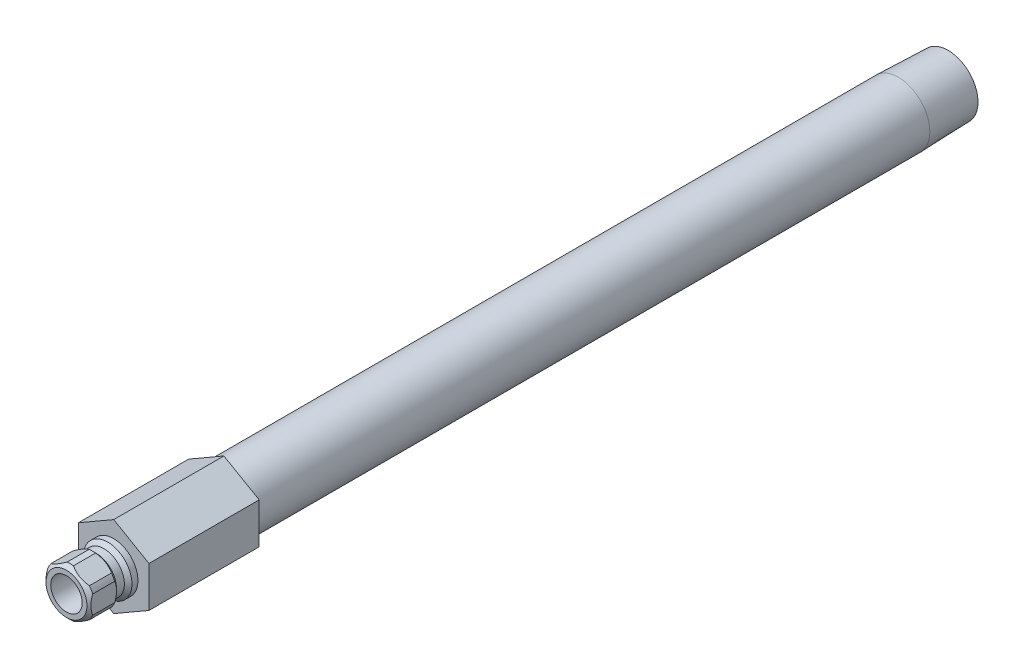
ISO-10303-21;
HEADER;
FILE_DESCRIPTION(('STEP AP214'),'2;1');
FILE_NAME('part.step','',(''),(''),'','','');
FILE_SCHEMA(('AUTOMOTIVE_DESIGN { 1 0 10303 214 1 1 1 1 }'));
ENDSEC;
DATA;
#1=APPLICATION_CONTEXT('core data for automotive mechanical design processes');
#2=APPLICATION_PROTOCOL_DEFINITION('international standard','automotive_design',2000,#1);
#3=PRODUCT_CONTEXT('',#1,'mechanical');
#4=PRODUCT('Part','Part','',(#3));
#5=PRODUCT_RELATED_PRODUCT_CATEGORY('part','',(#4));
#6=PRODUCT_DEFINITION_FORMATION('','',#4);
#7=PRODUCT_DEFINITION_CONTEXT('part definition',#1,'design');
#8=PRODUCT_DEFINITION('design','',#6,#7);
#9=PRODUCT_DEFINITION_SHAPE('','',#8);
#10=(LENGTH_UNIT() NAMED_UNIT(*) SI_UNIT(.MILLI.,.METRE.));
#11=(NAMED_UNIT(*) PLANE_ANGLE_UNIT() SI_UNIT($,.RADIAN.));
#12=(NAMED_UNIT(*) SI_UNIT($,.STERADIAN.) SOLID_ANGLE_UNIT());
#13=UNCERTAINTY_MEASURE_WITH_UNIT(LENGTH_MEASURE(1.E-05),#10,'distance_accuracy_value','');
#14=(GEOMETRIC_REPRESENTATION_CONTEXT(3) GLOBAL_UNCERTAINTY_ASSIGNED_CONTEXT((#13)) GLOBAL_UNIT_ASSIGNED_CONTEXT((#10,
#11,#12)) REPRESENTATION_CONTEXT('',''));
#15=CARTESIAN_POINT('',(0.,0.,0.));
#16=DIRECTION('',(0.,0.,1.));
#17=DIRECTION('',(1.,0.,0.));
#18=AXIS2_PLACEMENT_3D('',#15,#16,#17);
#19=CARTESIAN_POINT('',(0.,0.,0.));
#20=DIRECTION('',(0.,0.,-1.));
#21=DIRECTION('',(0.,1.,0.));
#22=AXIS2_PLACEMENT_3D('',#19,#20,#21);
#23=CYLINDRICAL_SURFACE('',#22,4.8895);
#24=DIRECTION('',(0.,0.,-1.));
#25=VECTOR('',#24,1.);
#26=CARTESIAN_POINT('',(3.87288738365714,-2.98461950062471,0.));
#27=LINE('',#26,#25);
#28=CARTESIAN_POINT('',(3.87288738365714,-2.98461950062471,4.318));
#29=VERTEX_POINT('',#28);
#30=CARTESIAN_POINT('',(3.87288738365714,-2.98461950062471,8.76299999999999));
#31=VERTEX_POINT('',#30);
#32=EDGE_CURVE('E392',#29,#31,#27,.F.);
#33=ORIENTED_EDGE('',*,*,#32,.F.);
#34=CARTESIAN_POINT('',(0.,0.,4.318));
#35=DIRECTION('',(0.,0.,-1.));
#36=DIRECTION('',(0.,1.,0.));
#37=AXIS2_PLACEMENT_3D('',#34,#35,#36);
#38=CIRCLE('',#37,4.8895);
#39=CARTESIAN_POINT('',(4.5212,-1.86170910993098,4.318));
#40=VERTEX_POINT('',#39);
#41=EDGE_CURVE('E369',#40,#29,#38,.T.);
#42=ORIENTED_EDGE('',*,*,#41,.F.);
#43=DIRECTION('',(0.,0.,-1.));
#44=VECTOR('',#43,1.);
#45=CARTESIAN_POINT('',(4.5212,-1.86170910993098,0.));
#46=LINE('',#45,#44);
#47=CARTESIAN_POINT('',(4.5212,-1.86170910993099,8.76299999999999));
#48=VERTEX_POINT('',#47);
#49=EDGE_CURVE('E383',#48,#40,#46,.T.);
#50=ORIENTED_EDGE('',*,*,#49,.F.);
#51=CARTESIAN_POINT('',(0.,0.,8.76299999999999));
#52=DIRECTION('',(0.,0.,-1.));
#53=DIRECTION('',(0.,1.,0.));
#54=AXIS2_PLACEMENT_3D('',#51,#52,#53);
#55=CIRCLE('',#54,4.8895);
#56=EDGE_CURVE('E191',#48,#31,#55,.T.);
#57=ORIENTED_EDGE('',*,*,#56,.T.);
#58=EDGE_LOOP('',(#33,#42,#50,#57));
#59=FACE_BOUND('',#58,.T.);
#60=ADVANCED_FACE('F34',(#59),#23,.T.);
#61=DIRECTION('',(0.,0.,-1.));
#62=VECTOR('',#61,1.);
#63=CARTESIAN_POINT('',(4.5212,1.86170910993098,0.));
#64=LINE('',#63,#62);
#65=CARTESIAN_POINT('',(4.5212,1.86170910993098,4.318));
#66=VERTEX_POINT('',#65);
#67=CARTESIAN_POINT('',(4.5212,1.86170910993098,8.76299999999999));
#68=VERTEX_POINT('',#67);
#69=EDGE_CURVE('E295',#66,#68,#64,.F.);
#70=ORIENTED_EDGE('',*,*,#69,.F.);
#71=CARTESIAN_POINT('',(3.87288738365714,2.98461950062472,4.318));
#72=VERTEX_POINT('',#71);
#73=EDGE_CURVE('E204',#72,#66,#38,.T.);
#74=ORIENTED_EDGE('',*,*,#73,.F.);
#75=DIRECTION('',(0.,0.,-1.));
#76=VECTOR('',#75,1.);
#77=CARTESIAN_POINT('',(3.87288738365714,2.98461950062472,0.));
#78=LINE('',#77,#76);
#79=CARTESIAN_POINT('',(3.87288738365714,2.98461950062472,8.76299999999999));
#80=VERTEX_POINT('',#79);
#81=EDGE_CURVE('E380',#80,#72,#78,.T.);
#82=ORIENTED_EDGE('',*,*,#81,.F.);
#83=EDGE_CURVE('E198',#80,#68,#55,.T.);
#84=ORIENTED_EDGE('',*,*,#83,.T.);
#85=EDGE_LOOP('',(#70,#74,#82,#84));
#86=FACE_BOUND('',#85,.T.);
#87=ADVANCED_FACE('F329',(#86),#23,.T.);
#88=DIRECTION('',(0.,0.,-1.));
#89=VECTOR('',#88,1.);
#90=CARTESIAN_POINT('',(0.648312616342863,4.84632861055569,0.));
#91=LINE('',#90,#89);
#92=CARTESIAN_POINT('',(0.648312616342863,4.84632861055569,4.318));
#93=VERTEX_POINT('',#92);
#94=CARTESIAN_POINT('',(0.648312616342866,4.84632861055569,8.76299999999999));
#95=VERTEX_POINT('',#94);
#96=EDGE_CURVE('E385',#93,#95,#91,.F.);
#97=ORIENTED_EDGE('',*,*,#96,.F.);
#98=CARTESIAN_POINT('',(-0.648312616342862,4.84632861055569,4.318));
#99=VERTEX_POINT('',#98);
#100=EDGE_CURVE('E200',#99,#93,#38,.T.);
#101=ORIENTED_EDGE('',*,*,#100,.F.);
#102=DIRECTION('',(0.,0.,-1.));
#103=VECTOR('',#102,1.);
#104=CARTESIAN_POINT('',(-0.648312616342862,4.84632861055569,0.));
#105=LINE('',#104,#103);
#106=CARTESIAN_POINT('',(-0.648312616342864,4.84632861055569,8.76299999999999));
#107=VERTEX_POINT('',#106);
#108=EDGE_CURVE('E361',#107,#99,#105,.T.);
#109=ORIENTED_EDGE('',*,*,#108,.F.);
#110=EDGE_CURVE('E193',#107,#95,#55,.T.);
#111=ORIENTED_EDGE('',*,*,#110,.T.);
#112=EDGE_LOOP('',(#97,#101,#109,#111));
#113=FACE_BOUND('',#112,.T.);
#114=ADVANCED_FACE('F334',(#113),#23,.T.);
#115=DIRECTION('',(0.,0.,-1.));
#116=VECTOR('',#115,1.);
#117=CARTESIAN_POINT('',(-3.87288738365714,2.98461950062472,0.));
#118=LINE('',#117,#116);
#119=CARTESIAN_POINT('',(-3.87288738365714,2.98461950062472,4.318));
#120=VERTEX_POINT('',#119);
#121=CARTESIAN_POINT('',(-3.87288738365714,2.98461950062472,8.76299999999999));
#122=VERTEX_POINT('',#121);
#123=EDGE_CURVE('E54',#120,#122,#118,.F.);
#124=ORIENTED_EDGE('',*,*,#123,.F.);
#125=CARTESIAN_POINT('',(-4.5212,1.86170910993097,4.318));
#126=VERTEX_POINT('',#125);
#127=EDGE_CURVE('E203',#126,#120,#38,.T.);
#128=ORIENTED_EDGE('',*,*,#127,.F.);
#129=DIRECTION('',(0.,0.,-1.));
#130=VECTOR('',#129,1.);
#131=CARTESIAN_POINT('',(-4.5212,1.86170910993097,0.));
#132=LINE('',#131,#130);
#133=CARTESIAN_POINT('',(-4.5212,1.86170910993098,8.763));
#134=VERTEX_POINT('',#133);
#135=EDGE_CURVE('E249',#134,#126,#132,.T.);
#136=ORIENTED_EDGE('',*,*,#135,.F.);
#137=EDGE_CURVE('E189',#134,#122,#55,.T.);
#138=ORIENTED_EDGE('',*,*,#137,.T.);
#139=EDGE_LOOP('',(#124,#128,#136,#138));
#140=FACE_BOUND('',#139,.T.);
#141=ADVANCED_FACE('F346',(#140),#23,.T.);
#142=DIRECTION('',(0.,0.,-1.));
#143=VECTOR('',#142,1.);
#144=CARTESIAN_POINT('',(-4.5212,-1.86170910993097,0.));
#145=LINE('',#144,#143);
#146=CARTESIAN_POINT('',(-4.5212,-1.86170910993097,4.318));
#147=VERTEX_POINT('',#146);
#148=CARTESIAN_POINT('',(-4.5212,-1.86170910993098,8.76299999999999));
#149=VERTEX_POINT('',#148);
#150=EDGE_CURVE('E62',#147,#149,#145,.F.);
#151=ORIENTED_EDGE('',*,*,#150,.F.);
#152=CARTESIAN_POINT('',(-3.87288738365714,-2.98461950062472,4.318));
#153=VERTEX_POINT('',#152);
#154=EDGE_CURVE('E182',#153,#147,#38,.T.);
#155=ORIENTED_EDGE('',*,*,#154,.F.);
#156=DIRECTION('',(0.,0.,-1.));
#157=VECTOR('',#156,1.);
#158=CARTESIAN_POINT('',(-3.87288738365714,-2.98461950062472,0.));
#159=LINE('',#158,#157);
#160=CARTESIAN_POINT('',(-3.87288738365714,-2.98461950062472,8.76299999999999));
#161=VERTEX_POINT('',#160);
#162=EDGE_CURVE('E165',#161,#153,#159,.T.);
#163=ORIENTED_EDGE('',*,*,#162,.F.);
#164=EDGE_CURVE('E180',#161,#149,#55,.T.);
#165=ORIENTED_EDGE('',*,*,#164,.T.);
#166=EDGE_LOOP('',(#151,#155,#163,#165));
#167=FACE_BOUND('',#166,.T.);
#168=ADVANCED_FACE('F179',(#167),#23,.T.);
#169=CARTESIAN_POINT('',(0.,0.,0.));
#170=DIRECTION('',(0.,0.,-1.));
#171=DIRECTION('',(0.,1.,0.));
#172=AXIS2_PLACEMENT_3D('',#169,#170,#171);
#173=CYLINDRICAL_SURFACE('',#172,6.34999999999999);
#174=CARTESIAN_POINT('',(0.,0.,-158.242));
#175=DIRECTION('',(0.,0.,-1.));
#176=DIRECTION('',(0.,1.,0.));
#177=AXIS2_PLACEMENT_3D('',#174,#175,#176);
#178=CIRCLE('',#177,6.34999999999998);
#179=CARTESIAN_POINT('',(0.,6.35,-158.242));
#180=VERTEX_POINT('',#179);
#181=EDGE_CURVE('E217',#180,#180,#178,.T.);
#182=ORIENTED_EDGE('',*,*,#181,.F.);
#183=EDGE_LOOP('',(#182));
#184=FACE_BOUND('',#183,.T.);
#185=CARTESIAN_POINT('',(0.,0.,-22.225));
#186=DIRECTION('',(0.,0.,1.));
#187=DIRECTION('',(1.,0.,0.));
#188=AXIS2_PLACEMENT_3D('',#185,#186,#187);
#189=CIRCLE('',#188,6.34999999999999);
#190=CARTESIAN_POINT('',(6.34999999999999,0.,-22.225));
#191=VERTEX_POINT('',#190);
#192=EDGE_CURVE('E438',#191,#191,#189,.F.);
#193=ORIENTED_EDGE('',*,*,#192,.T.);
#194=EDGE_LOOP('',(#193));
#195=FACE_BOUND('',#194,.T.);
#196=ADVANCED_FACE('F345',(#184,#195),#173,.T.);
#197=CARTESIAN_POINT('',(0.,6.03647060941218,-168.275));
#198=DIRECTION('',(0.,0.,-1.));
#199=DIRECTION('',(0.,1.,0.));
#200=AXIS2_PLACEMENT_3D('',#197,#198,#199);
#201=PLANE('',#200);
#202=CARTESIAN_POINT('',(0.,0.,-168.275));
#203=DIRECTION('',(0.,0.,-1.));
#204=DIRECTION('',(0.,1.,0.));
#205=AXIS2_PLACEMENT_3D('',#202,#203,#204);
#206=CIRCLE('',#205,6.03647060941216);
#207=CARTESIAN_POINT('',(0.,6.03647060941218,-168.275));
#208=VERTEX_POINT('',#207);
#209=EDGE_CURVE('E174',#208,#208,#206,.T.);
#210=ORIENTED_EDGE('',*,*,#209,.T.);
#211=EDGE_LOOP('',(#210));
#212=FACE_BOUND('',#211,.T.);
#213=CARTESIAN_POINT('',(0.,0.,-168.275));
#214=DIRECTION('',(0.,0.,-1.));
#215=DIRECTION('',(0.,1.,0.));
#216=AXIS2_PLACEMENT_3D('',#213,#214,#215);
#217=CIRCLE('',#216,4.62279999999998);
#218=CARTESIAN_POINT('',(0.,4.6228,-168.275));
#219=VERTEX_POINT('',#218);
#220=EDGE_CURVE('E450',#219,#219,#217,.T.);
#221=ORIENTED_EDGE('',*,*,#220,.F.);
#222=EDGE_LOOP('',(#221));
#223=FACE_BOUND('',#222,.T.);
#224=ADVANCED_FACE('F36',(#212,#223),#201,.T.);
#225=CARTESIAN_POINT('',(0.,0.,-168.275));
#226=DIRECTION('',(0.,0.,1.));
#227=DIRECTION('',(0.,-1.,0.));
#228=AXIS2_PLACEMENT_3D('',#225,#226,#227);
#229=CONICAL_SURFACE('',#228,6.03647060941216,0.0312396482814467);
#230=ORIENTED_EDGE('',*,*,#181,.T.);
#231=EDGE_LOOP('',(#230));
#232=FACE_BOUND('',#231,.T.);
#233=ORIENTED_EDGE('',*,*,#209,.F.);
#234=EDGE_LOOP('',(#233));
#235=FACE_BOUND('',#234,.T.);
#236=ADVANCED_FACE('F526',(#232,#235),#229,.T.);
#237=CARTESIAN_POINT('',(0.,4.8895,0.));
#238=DIRECTION('',(0.,0.,1.));
#239=DIRECTION('',(0.,-1.,0.));
#240=AXIS2_PLACEMENT_3D('',#237,#238,#239);
#241=PLANE('',#240);
#242=CARTESIAN_POINT('',(0.,0.,0.));
#243=DIRECTION('',(0.,0.,-1.));
#244=DIRECTION('',(0.,1.,0.));
#245=AXIS2_PLACEMENT_3D('',#242,#243,#244);
#246=CIRCLE('',#245,4.8895);
#247=CARTESIAN_POINT('',(0.,4.8895,0.));
#248=VERTEX_POINT('',#247);
#249=EDGE_CURVE('E214',#248,#248,#246,.T.);
#250=ORIENTED_EDGE('',*,*,#249,.T.);
#251=EDGE_LOOP('',(#250));
#252=FACE_BOUND('',#251,.T.);
#253=DIRECTION('',(-0.866025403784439,-0.5,0.));
#254=VECTOR('',#253,1.);
#255=CARTESIAN_POINT('',(0.,8.21223022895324,0.));
#256=LINE('',#255,#254);
#257=CARTESIAN_POINT('',(0.,8.21223022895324,0.));
#258=VERTEX_POINT('',#257);
#259=CARTESIAN_POINT('',(-7.112,4.10611511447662,0.));
#260=VERTEX_POINT('',#259);
#261=EDGE_CURVE('E395',#258,#260,#256,.T.);
#262=ORIENTED_EDGE('',*,*,#261,.T.);
#263=DIRECTION('',(0.,-1.,0.));
#264=VECTOR('',#263,1.);
#265=CARTESIAN_POINT('',(-7.112,4.10611511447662,0.));
#266=LINE('',#265,#264);
#267=CARTESIAN_POINT('',(-7.112,-4.10611511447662,0.));
#268=VERTEX_POINT('',#267);
#269=EDGE_CURVE('E422',#260,#268,#266,.T.);
#270=ORIENTED_EDGE('',*,*,#269,.T.);
#271=DIRECTION('',(0.866025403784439,-0.5,0.));
#272=VECTOR('',#271,1.);
#273=CARTESIAN_POINT('',(-7.112,-4.10611511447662,0.));
#274=LINE('',#273,#272);
#275=CARTESIAN_POINT('',(0.,-8.21223022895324,0.));
#276=VERTEX_POINT('',#275);
#277=EDGE_CURVE('E425',#268,#276,#274,.T.);
#278=ORIENTED_EDGE('',*,*,#277,.T.);
#279=DIRECTION('',(0.866025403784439,0.5,0.));
#280=VECTOR('',#279,1.);
#281=CARTESIAN_POINT('',(0.,-8.21223022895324,0.));
#282=LINE('',#281,#280);
#283=CARTESIAN_POINT('',(7.112,-4.10611511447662,0.));
#284=VERTEX_POINT('',#283);
#285=EDGE_CURVE('E428',#276,#284,#282,.T.);
#286=ORIENTED_EDGE('',*,*,#285,.T.);
#287=DIRECTION('',(0.,1.,0.));
#288=VECTOR('',#287,1.);
#289=CARTESIAN_POINT('',(7.112,-4.10611511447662,0.));
#290=LINE('',#289,#288);
#291=CARTESIAN_POINT('',(7.112,4.10611511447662,0.));
#292=VERTEX_POINT('',#291);
#293=EDGE_CURVE('E431',#284,#292,#290,.T.);
#294=ORIENTED_EDGE('',*,*,#293,.T.);
#295=DIRECTION('',(-0.866025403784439,0.5,0.));
#296=VECTOR('',#295,1.);
#297=CARTESIAN_POINT('',(7.112,4.10611511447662,0.));
#298=LINE('',#297,#296);
#299=EDGE_CURVE('E404',#292,#258,#298,.T.);
#300=ORIENTED_EDGE('',*,*,#299,.T.);
#301=EDGE_LOOP('',(#262,#270,#278,#286,#294,#300));
#302=FACE_BOUND('',#301,.T.);
#303=ADVANCED_FACE('F523',(#252,#302),#241,.T.);
#304=CARTESIAN_POINT('',(0.,0.,0.));
#305=DIRECTION('',(0.,0.,-1.));
#306=DIRECTION('',(0.,1.,0.));
#307=AXIS2_PLACEMENT_3D('',#304,#305,#306);
#308=CYLINDRICAL_SURFACE('',#307,4.8895);
#309=CARTESIAN_POINT('',(0.,0.,1.2065));
#310=DIRECTION('',(0.,0.,-1.));
#311=DIRECTION('',(0.,1.,0.));
#312=AXIS2_PLACEMENT_3D('',#309,#310,#311);
#313=CIRCLE('',#312,4.8895);
#314=CARTESIAN_POINT('',(0.,4.8895,1.2065));
#315=VERTEX_POINT('',#314);
#316=EDGE_CURVE('E211',#315,#315,#313,.T.);
#317=ORIENTED_EDGE('',*,*,#316,.T.);
#318=EDGE_LOOP('',(#317));
#319=FACE_BOUND('',#318,.T.);
#320=ORIENTED_EDGE('',*,*,#249,.F.);
#321=EDGE_LOOP('',(#320));
#322=FACE_BOUND('',#321,.T.);
#323=ADVANCED_FACE('F525',(#319,#322),#308,.T.);
#324=CARTESIAN_POINT('',(0.,0.,1.2065));
#325=DIRECTION('',(0.,0.,-1.));
#326=DIRECTION('',(0.,1.,0.));
#327=AXIS2_PLACEMENT_3D('',#324,#325,#326);
#328=CONICAL_SURFACE('',#327,4.8895,0.785398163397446);
#329=CARTESIAN_POINT('',(0.,0.,1.9685));
#330=DIRECTION('',(0.,0.,-1.));
#331=DIRECTION('',(0.,1.,0.));
#332=AXIS2_PLACEMENT_3D('',#329,#330,#331);
#333=CIRCLE('',#332,4.1275);
#334=CARTESIAN_POINT('',(0.,4.1275,1.9685));
#335=VERTEX_POINT('',#334);
#336=EDGE_CURVE('E208',#335,#335,#333,.T.);
#337=ORIENTED_EDGE('',*,*,#336,.T.);
#338=EDGE_LOOP('',(#337));
#339=FACE_BOUND('',#338,.T.);
#340=ORIENTED_EDGE('',*,*,#316,.F.);
#341=EDGE_LOOP('',(#340));
#342=FACE_BOUND('',#341,.T.);
#343=ADVANCED_FACE('F533',(#339,#342),#328,.T.);
#344=CARTESIAN_POINT('',(0.,0.,0.));
#345=DIRECTION('',(0.,0.,-1.));
#346=DIRECTION('',(0.,1.,0.));
#347=AXIS2_PLACEMENT_3D('',#344,#345,#346);
#348=CYLINDRICAL_SURFACE('',#347,4.1275);
#349=CARTESIAN_POINT('',(0.,0.,3.556));
#350=DIRECTION('',(0.,0.,-1.));
#351=DIRECTION('',(0.,1.,0.));
#352=AXIS2_PLACEMENT_3D('',#349,#350,#351);
#353=CIRCLE('',#352,4.1275);
#354=CARTESIAN_POINT('',(0.,4.1275,3.556));
#355=VERTEX_POINT('',#354);
#356=EDGE_CURVE('E205',#355,#355,#353,.T.);
#357=ORIENTED_EDGE('',*,*,#356,.T.);
#358=EDGE_LOOP('',(#357));
#359=FACE_BOUND('',#358,.T.);
#360=ORIENTED_EDGE('',*,*,#336,.F.);
#361=EDGE_LOOP('',(#360));
#362=FACE_BOUND('',#361,.T.);
#363=ADVANCED_FACE('F256',(#359,#362),#348,.T.);
#364=CARTESIAN_POINT('',(0.,0.,3.556));
#365=DIRECTION('',(0.,0.,1.));
#366=DIRECTION('',(0.,-1.,0.));
#367=AXIS2_PLACEMENT_3D('',#364,#365,#366);
#368=CONICAL_SURFACE('',#367,4.1275,0.785398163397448);
#369=CARTESIAN_POINT('',(0.64785777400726,-4.84659121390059,4.3182));
#370=CARTESIAN_POINT('',(0.775261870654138,-4.77303442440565,4.26213711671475));
#371=CARTESIAN_POINT('',(0.904457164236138,-4.69844348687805,4.21102627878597));
#372=CARTESIAN_POINT('',(1.16629518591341,-4.5472712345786,4.12074318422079));
#373=CARTESIAN_POINT('',(1.2989462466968,-4.47068510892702,4.08160338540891));
#374=CARTESIAN_POINT('',(1.56203676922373,-4.31878972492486,4.01877592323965));
#375=CARTESIAN_POINT('',(1.69238331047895,-4.24353411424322,3.99458163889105));
#376=CARTESIAN_POINT('',(1.95434729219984,-4.09228913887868,3.96102228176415));
#377=CARTESIAN_POINT('',(2.0859628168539,-4.01630088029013,3.951637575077));
#378=CARTESIAN_POINT('',(2.35623055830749,-3.86026172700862,3.9482192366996));
#379=CARTESIAN_POINT('',(2.49489129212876,-3.78020591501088,3.95501290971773));
#380=CARTESIAN_POINT('',(2.77103341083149,-3.62077518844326,3.98518499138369));
#381=CARTESIAN_POINT('',(2.90851272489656,-3.54140146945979,4.00858815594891));
#382=CARTESIAN_POINT('',(3.18622016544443,-3.38106700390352,4.07155129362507));
#383=CARTESIAN_POINT('',(3.32634361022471,-3.30016669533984,4.11171074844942));
#384=CARTESIAN_POINT('',(3.60275664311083,-3.14057955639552,4.20550294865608));
#385=CARTESIAN_POINT('',(3.73905611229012,-3.06188702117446,4.25909654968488));
#386=CARTESIAN_POINT('',(3.87334222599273,-2.98435689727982,4.3182));
#387=B_SPLINE_CURVE_WITH_KNOTS('',3,(#369,#370,#371,#372,#373,#374,#375,#376,#377,#378,#379,
#380,#381,#382,#383,#384,#385,#386),.UNSPECIFIED.,.F.,.F.,(4,2,2,2,2,2,2,2,4),(0.,
0.472469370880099,0.946208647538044,1.40285320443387,1.85889185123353,2.33874707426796,
2.81931901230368,3.31879975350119,3.81684169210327),.UNSPECIFIED.);
#388=CARTESIAN_POINT('',(0.648312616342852,-4.84632861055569,4.318));
#389=VERTEX_POINT('',#388);
#390=EDGE_CURVE('E394',#389,#29,#387,.T.);
#391=ORIENTED_EDGE('',*,*,#390,.F.);
#392=CARTESIAN_POINT('',(-0.648312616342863,-4.84632861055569,4.318));
#393=VERTEX_POINT('',#392);
#394=EDGE_CURVE('E367',#389,#393,#38,.T.);
#395=ORIENTED_EDGE('',*,*,#394,.T.);
#396=CARTESIAN_POINT('',(-3.87334222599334,-2.98435689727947,4.31820000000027));
#397=CARTESIAN_POINT('',(-3.74593812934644,-3.05791368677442,4.26213711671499));
#398=CARTESIAN_POINT('',(-3.61674283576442,-3.13250462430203,4.21102627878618));
#399=CARTESIAN_POINT('',(-3.35490481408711,-3.28367687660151,4.12074318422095));
#400=CARTESIAN_POINT('',(-3.22225375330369,-3.3602630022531,4.08160338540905));
#401=CARTESIAN_POINT('',(-2.95916323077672,-3.51215838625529,4.01877592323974));
#402=CARTESIAN_POINT('',(-2.82881668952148,-3.58741399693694,3.99458163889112));
#403=CARTESIAN_POINT('',(-2.56685270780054,-3.73865897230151,3.96102228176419));
#404=CARTESIAN_POINT('',(-2.43523718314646,-3.81464723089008,3.95163757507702));
#405=CARTESIAN_POINT('',(-2.16496944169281,-3.97068638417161,3.94821923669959));
#406=CARTESIAN_POINT('',(-2.02630870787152,-4.05074219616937,3.95501290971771));
#407=CARTESIAN_POINT('',(-1.75016658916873,-4.21017292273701,3.98518499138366));
#408=CARTESIAN_POINT('',(-1.61268727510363,-4.28954664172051,4.00858815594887));
#409=CARTESIAN_POINT('',(-1.33497983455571,-4.44988110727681,4.07155129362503));
#410=CARTESIAN_POINT('',(-1.1948563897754,-4.5307814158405,4.11171074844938));
#411=CARTESIAN_POINT('',(-0.918443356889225,-4.69036855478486,4.20550294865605));
#412=CARTESIAN_POINT('',(-0.782143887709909,-4.76906109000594,4.25909654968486));
#413=CARTESIAN_POINT('',(-0.647857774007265,-4.84659121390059,4.3182));
#414=B_SPLINE_CURVE_WITH_KNOTS('',3,(#396,#397,#398,#399,#400,#401,#402,#403,#404,#405,#406,
#407,#408,#409,#410,#411,#412,#413),.UNSPECIFIED.,.F.,.F.,(4,2,2,2,2,2,2,2,4),(0.,
0.472469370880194,0.946208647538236,1.40285320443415,1.85889185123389,2.33874707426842,
2.81931901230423,3.31879975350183,3.81684169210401),.UNSPECIFIED.);
#415=EDGE_CURVE('E242',#153,#393,#414,.T.);
#416=ORIENTED_EDGE('',*,*,#415,.F.);
#417=ORIENTED_EDGE('',*,*,#154,.T.);
#418=CARTESIAN_POINT('',(-4.5212,-5.15925306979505,6.2884665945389));
#419=CARTESIAN_POINT('',(-4.5212,-5.03341781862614,6.19384981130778));
#420=CARTESIAN_POINT('',(-4.5212,-4.90687282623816,6.10016148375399));
#421=CARTESIAN_POINT('',(-4.5212,-4.65208542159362,5.91505573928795));
#422=CARTESIAN_POINT('',(-4.5212,-4.52384258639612,5.82363890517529));
#423=CARTESIAN_POINT('',(-4.5212,-4.26444371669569,5.64284060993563));
#424=CARTESIAN_POINT('',(-4.5212,-4.13327280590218,5.55348041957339));
#425=CARTESIAN_POINT('',(-4.5212,-3.86869655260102,5.37814219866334));
#426=CARTESIAN_POINT('',(-4.5212,-3.735291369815,5.29216392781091));
#427=CARTESIAN_POINT('',(-4.5212,-3.45835736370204,5.1196421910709));
#428=CARTESIAN_POINT('',(-4.5212,-3.31467977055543,5.03333631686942));
#429=CARTESIAN_POINT('',(-4.5212,-3.02397608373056,4.86646929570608));
#430=CARTESIAN_POINT('',(-4.5212,-2.87694947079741,4.78590904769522));
#431=CARTESIAN_POINT('',(-4.5212,-2.57957206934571,4.6322757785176));
#432=CARTESIAN_POINT('',(-4.5212,-2.42923274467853,4.55918074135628));
#433=CARTESIAN_POINT('',(-4.5212,-2.12448469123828,4.4221138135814));
#434=CARTESIAN_POINT('',(-4.5212,-1.97007782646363,4.35813782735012));
#435=CARTESIAN_POINT('',(-4.5212,-1.66898205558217,4.24604782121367));
#436=CARTESIAN_POINT('',(-4.5212,-1.52260919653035,4.19709368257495));
#437=CARTESIAN_POINT('',(-4.5212,-1.22638031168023,4.11093488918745));
#438=CARTESIAN_POINT('',(-4.5212,-1.07652404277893,4.07373105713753));
#439=CARTESIAN_POINT('',(-4.5212,-0.776693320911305,4.01362130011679));
#440=CARTESIAN_POINT('',(-4.5212,-0.6267682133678,3.99047322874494));
#441=CARTESIAN_POINT('',(-4.5212,-0.32536672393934,3.95891692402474));
#442=CARTESIAN_POINT('',(-4.5212,-0.173890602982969,3.95050625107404));
#443=CARTESIAN_POINT('',(-4.5212,0.123852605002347,3.94903068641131));
#444=CARTESIAN_POINT('',(-4.5212,0.270117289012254,3.95544130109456));
#445=CARTESIAN_POINT('',(-4.5212,0.561370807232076,3.98210770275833));
#446=CARTESIAN_POINT('',(-4.5212,0.706359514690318,4.00236484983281));
#447=CARTESIAN_POINT('',(-4.5212,0.996462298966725,4.05597163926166));
#448=CARTESIAN_POINT('',(-4.5212,1.14153485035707,4.08954247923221));
#449=CARTESIAN_POINT('',(-4.5212,1.42852462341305,4.16800024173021));
#450=CARTESIAN_POINT('',(-4.5212,1.5704421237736,4.21288616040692));
#451=CARTESIAN_POINT('',(-4.5212,1.86505501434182,4.3171412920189));
#452=CARTESIAN_POINT('',(-4.5212,2.01739126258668,4.37751543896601));
#453=CARTESIAN_POINT('',(-4.5212,2.31809735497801,4.5075182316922));
#454=CARTESIAN_POINT('',(-4.5212,2.46646529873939,4.57715121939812));
#455=CARTESIAN_POINT('',(-4.5212,2.75996557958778,4.72401353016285));
#456=CARTESIAN_POINT('',(-4.5212,2.90508583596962,4.80126680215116));
#457=CARTESIAN_POINT('',(-4.5212,3.19198335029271,4.96166050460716));
#458=CARTESIAN_POINT('',(-4.5212,3.33376113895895,5.04479999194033));
#459=CARTESIAN_POINT('',(-4.5212,3.6074215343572,5.21154136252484));
#460=CARTESIAN_POINT('',(-4.5212,3.73944496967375,5.29491333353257));
#461=CARTESIAN_POINT('',(-4.5212,4.00122581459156,5.46515273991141));
#462=CARTESIAN_POINT('',(-4.5212,4.13098305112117,5.55202044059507));
#463=CARTESIAN_POINT('',(-4.5212,4.38747396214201,5.7279062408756));
#464=CARTESIAN_POINT('',(-4.5212,4.51422365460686,5.81690106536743));
#465=CARTESIAN_POINT('',(-4.5212,4.76599253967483,5.99723636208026));
#466=CARTESIAN_POINT('',(-4.5212,4.89101219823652,6.08857618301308));
#467=CARTESIAN_POINT('',(-4.5212,5.01530771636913,6.18087446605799));
#468=B_SPLINE_CURVE_WITH_KNOTS('',3,(#418,#419,#420,#421,#422,#423,#424,#425,#426,#427,#428,
#429,#430,#431,#432,#433,#434,#435,#436,#437,#438,#439,#440,#441,#442,#443,#444,#445,#446,#447,
#448,#449,#450,#451,#452,#453,#454,#455,#456,#457,#458,#459,#460,#461,#462,#463,#464,#465,#466,
#467),.UNSPECIFIED.,.F.,.F.,(4,2,2,2,2,2,2,2,2,2,2,2,2,2,2,2,2,2,2,2,2,2,2,2,4),(0.,
0.472324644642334,0.944769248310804,1.42087610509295,1.89694907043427,2.39966187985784,
2.90245317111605,3.40371602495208,3.90475303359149,4.36737130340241,4.8300219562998,
5.28445770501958,5.73881822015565,6.17734710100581,6.61591906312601,7.06210522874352,
7.50825182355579,7.99945943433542,8.49089821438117,8.98393391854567,9.4768908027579,
9.94525924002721,10.4136632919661,10.8782525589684,11.3427141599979),.UNSPECIFIED.);
#469=EDGE_CURVE('E265',#126,#147,#468,.F.);
#470=ORIENTED_EDGE('',*,*,#469,.F.);
#471=ORIENTED_EDGE('',*,*,#127,.T.);
#472=CARTESIAN_POINT('',(-0.647857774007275,4.84659121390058,4.3182));
#473=CARTESIAN_POINT('',(-0.775261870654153,4.77303442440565,4.26213711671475));
#474=CARTESIAN_POINT('',(-0.904457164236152,4.69844348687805,4.21102627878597));
#475=CARTESIAN_POINT('',(-1.16629518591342,4.5472712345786,4.12074318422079));
#476=CARTESIAN_POINT('',(-1.29894624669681,4.47068510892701,4.08160338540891));
#477=CARTESIAN_POINT('',(-1.56203676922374,4.31878972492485,4.01877592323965));
#478=CARTESIAN_POINT('',(-1.69238331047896,4.24353411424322,3.99458163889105));
#479=CARTESIAN_POINT('',(-1.95434729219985,4.09228913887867,3.96102228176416));
#480=CARTESIAN_POINT('',(-2.0859628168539,4.01630088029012,3.95163757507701));
#481=CARTESIAN_POINT('',(-2.35623055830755,3.86026172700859,3.94821923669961));
#482=CARTESIAN_POINT('',(-2.49489129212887,3.78020591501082,3.95501290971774));
#483=CARTESIAN_POINT('',(-2.7710334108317,3.62077518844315,3.98518499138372));
#484=CARTESIAN_POINT('',(-2.90851272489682,3.54140146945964,4.00858815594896));
#485=CARTESIAN_POINT('',(-3.18622016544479,3.38106700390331,4.07155129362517));
#486=CARTESIAN_POINT('',(-3.32634361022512,3.30016669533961,4.11171074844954));
#487=CARTESIAN_POINT('',(-3.60275664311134,3.14057955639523,4.20550294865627));
#488=CARTESIAN_POINT('',(-3.73905611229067,3.06188702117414,4.2590965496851));
#489=CARTESIAN_POINT('',(-3.87334222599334,2.98435689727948,4.31820000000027));
#490=B_SPLINE_CURVE_WITH_KNOTS('',3,(#472,#473,#474,#475,#476,#477,#478,#479,#480,#481,#482,
#483,#484,#485,#486,#487,#488,#489),.UNSPECIFIED.,.F.,.F.,(4,2,2,2,2,2,2,2,4),(0.,
0.472469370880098,0.946208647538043,1.40285320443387,1.85889185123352,2.33874707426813,
2.81931901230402,3.31879975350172,3.81684169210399),.UNSPECIFIED.);
#491=EDGE_CURVE('E272',#99,#120,#490,.T.);
#492=ORIENTED_EDGE('',*,*,#491,.F.);
#493=ORIENTED_EDGE('',*,*,#100,.T.);
#494=CARTESIAN_POINT('',(3.87334222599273,2.98435689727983,4.3182));
#495=CARTESIAN_POINT('',(3.74593812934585,3.05791368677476,4.26213711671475));
#496=CARTESIAN_POINT('',(3.61674283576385,3.13250462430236,4.21102627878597));
#497=CARTESIAN_POINT('',(3.35490481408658,3.28367687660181,4.12074318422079));
#498=CARTESIAN_POINT('',(3.22225375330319,3.36026300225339,4.08160338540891));
#499=CARTESIAN_POINT('',(2.95916323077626,3.51215838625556,4.01877592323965));
#500=CARTESIAN_POINT('',(2.82881668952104,3.58741399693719,3.99458163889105));
#501=CARTESIAN_POINT('',(2.56685270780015,3.73865897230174,3.96102228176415));
#502=CARTESIAN_POINT('',(2.4352371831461,3.81464723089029,3.95163757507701));
#503=CARTESIAN_POINT('',(2.16496944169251,3.97068638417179,3.94821923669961));
#504=CARTESIAN_POINT('',(2.02630870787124,4.05074219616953,3.95501290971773));
#505=CARTESIAN_POINT('',(1.75016658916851,4.21017292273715,3.98518499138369));
#506=CARTESIAN_POINT('',(1.61268727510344,4.28954664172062,4.00858815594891));
#507=CARTESIAN_POINT('',(1.33497983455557,4.44988110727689,4.07155129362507));
#508=CARTESIAN_POINT('',(1.19485638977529,4.53078141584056,4.11171074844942));
#509=CARTESIAN_POINT('',(0.918443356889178,4.69036855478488,4.20550294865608));
#510=CARTESIAN_POINT('',(0.78214388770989,4.76906109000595,4.25909654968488));
#511=CARTESIAN_POINT('',(0.647857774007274,4.84659121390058,4.3182));
#512=B_SPLINE_CURVE_WITH_KNOTS('',3,(#494,#495,#496,#497,#498,#499,#500,#501,#502,#503,#504,
#505,#506,#507,#508,#509,#510,#511),.UNSPECIFIED.,.F.,.F.,(4,2,2,2,2,2,2,2,4),(0.,
0.472469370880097,0.946208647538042,1.40285320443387,1.85889185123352,2.33874707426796,
2.81931901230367,3.31879975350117,3.81684169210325),.UNSPECIFIED.);
#513=EDGE_CURVE('E279',#72,#93,#512,.T.);
#514=ORIENTED_EDGE('',*,*,#513,.F.);
#515=ORIENTED_EDGE('',*,*,#73,.T.);
#516=CARTESIAN_POINT('',(4.5212,-5.15925306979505,6.2884665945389));
#517=CARTESIAN_POINT('',(4.5212,-5.03341781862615,6.19384981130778));
#518=CARTESIAN_POINT('',(4.5212,-4.90687282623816,6.10016148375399));
#519=CARTESIAN_POINT('',(4.5212,-4.65208542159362,5.91505573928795));
#520=CARTESIAN_POINT('',(4.5212,-4.52384258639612,5.82363890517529));
#521=CARTESIAN_POINT('',(4.5212,-4.26444371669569,5.64284060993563));
#522=CARTESIAN_POINT('',(4.5212,-4.13327280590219,5.55348041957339));
#523=CARTESIAN_POINT('',(4.5212,-3.86869655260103,5.37814219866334));
#524=CARTESIAN_POINT('',(4.5212,-3.735291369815,5.29216392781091));
#525=CARTESIAN_POINT('',(4.5212,-3.45835736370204,5.1196421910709));
#526=CARTESIAN_POINT('',(4.5212,-3.31467977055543,5.03333631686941));
#527=CARTESIAN_POINT('',(4.5212,-3.02397608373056,4.86646929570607));
#528=CARTESIAN_POINT('',(4.5212,-2.87694947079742,4.78590904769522));
#529=CARTESIAN_POINT('',(4.5212,-2.57957206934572,4.6322757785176));
#530=CARTESIAN_POINT('',(4.5212,-2.42923274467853,4.55918074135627));
#531=CARTESIAN_POINT('',(4.5212,-2.12448469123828,4.4221138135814));
#532=CARTESIAN_POINT('',(4.5212,-1.97007782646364,4.35813782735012));
#533=CARTESIAN_POINT('',(4.5212,-1.66898205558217,4.24604782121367));
#534=CARTESIAN_POINT('',(4.5212,-1.52260919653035,4.19709368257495));
#535=CARTESIAN_POINT('',(4.5212,-1.22638031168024,4.11093488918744));
#536=CARTESIAN_POINT('',(4.5212,-1.07652404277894,4.07373105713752));
#537=CARTESIAN_POINT('',(4.5212,-0.776693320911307,4.01362130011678));
#538=CARTESIAN_POINT('',(4.5212,-0.626768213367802,3.99047322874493));
#539=CARTESIAN_POINT('',(4.5212,-0.325366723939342,3.95891692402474));
#540=CARTESIAN_POINT('',(4.5212,-0.173890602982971,3.95050625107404));
#541=CARTESIAN_POINT('',(4.5212,0.123852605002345,3.94903068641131));
#542=CARTESIAN_POINT('',(4.5212,0.270117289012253,3.95544130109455));
#543=CARTESIAN_POINT('',(4.5212,0.561370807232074,3.98210770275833));
#544=CARTESIAN_POINT('',(4.5212,0.706359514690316,4.0023648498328));
#545=CARTESIAN_POINT('',(4.5212,0.996462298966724,4.05597163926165));
#546=CARTESIAN_POINT('',(4.5212,1.14153485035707,4.08954247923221));
#547=CARTESIAN_POINT('',(4.5212,1.42852462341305,4.16800024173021));
#548=CARTESIAN_POINT('',(4.5212,1.5704421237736,4.21288616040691));
#549=CARTESIAN_POINT('',(4.5212,1.86505501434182,4.3171412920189));
#550=CARTESIAN_POINT('',(4.5212,2.01739126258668,4.37751543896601));
#551=CARTESIAN_POINT('',(4.5212,2.31809735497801,4.5075182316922));
#552=CARTESIAN_POINT('',(4.5212,2.46646529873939,4.57715121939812));
#553=CARTESIAN_POINT('',(4.5212,2.75996557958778,4.72401353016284));
#554=CARTESIAN_POINT('',(4.5212,2.90508583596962,4.80126680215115));
#555=CARTESIAN_POINT('',(4.5212,3.19198335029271,4.96166050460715));
#556=CARTESIAN_POINT('',(4.5212,3.33376113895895,5.04479999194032));
#557=CARTESIAN_POINT('',(4.5212,3.6074215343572,5.21154136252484));
#558=CARTESIAN_POINT('',(4.5212,3.73944496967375,5.29491333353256));
#559=CARTESIAN_POINT('',(4.5212,4.00122581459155,5.4651527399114));
#560=CARTESIAN_POINT('',(4.5212,4.13098305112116,5.55202044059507));
#561=CARTESIAN_POINT('',(4.5212,4.38747396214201,5.72790624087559));
#562=CARTESIAN_POINT('',(4.5212,4.51422365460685,5.81690106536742));
#563=CARTESIAN_POINT('',(4.5212,4.76599253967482,5.99723636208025));
#564=CARTESIAN_POINT('',(4.5212,4.89101219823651,6.08857618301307));
#565=CARTESIAN_POINT('',(4.5212,5.01530771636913,6.18087446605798));
#566=B_SPLINE_CURVE_WITH_KNOTS('',3,(#516,#517,#518,#519,#520,#521,#522,#523,#524,#525,#526,
#527,#528,#529,#530,#531,#532,#533,#534,#535,#536,#537,#538,#539,#540,#541,#542,#543,#544,#545,
#546,#547,#548,#549,#550,#551,#552,#553,#554,#555,#556,#557,#558,#559,#560,#561,#562,#563,#564,
#565),.UNSPECIFIED.,.F.,.F.,(4,2,2,2,2,2,2,2,2,2,2,2,2,2,2,2,2,2,2,2,2,2,2,2,4),(0.,
0.472324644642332,0.944769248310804,1.42087610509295,1.89694907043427,2.39966187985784,
2.90245317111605,3.40371602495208,3.90475303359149,4.36737130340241,4.8300219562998,
5.28445770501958,5.73881822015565,6.17734710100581,6.61591906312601,7.06210522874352,
7.50825182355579,7.99945943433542,8.49089821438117,8.98393391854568,9.47689080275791,
9.94525924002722,10.4136632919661,10.8782525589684,11.3427141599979),.UNSPECIFIED.);
#567=EDGE_CURVE('E287',#40,#66,#566,.T.);
#568=ORIENTED_EDGE('',*,*,#567,.F.);
#569=ORIENTED_EDGE('',*,*,#41,.T.);
#570=EDGE_LOOP('',(#391,#395,#416,#417,#470,#471,#492,#493,#514,#515,#568,#569));
#571=FACE_BOUND('',#570,.T.);
#572=ORIENTED_EDGE('',*,*,#356,.F.);
#573=EDGE_LOOP('',(#572));
#574=FACE_BOUND('',#573,.T.);
#575=ADVANCED_FACE('F251',(#571,#574),#368,.T.);
#576=DIRECTION('',(0.,0.,-1.));
#577=VECTOR('',#576,1.);
#578=CARTESIAN_POINT('',(0.648312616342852,-4.84632861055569,0.));
#579=LINE('',#578,#577);
#580=CARTESIAN_POINT('',(0.648312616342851,-4.84632861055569,8.76299999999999));
#581=VERTEX_POINT('',#580);
#582=EDGE_CURVE('E294',#581,#389,#579,.T.);
#583=ORIENTED_EDGE('',*,*,#582,.F.);
#584=CARTESIAN_POINT('',(-0.648312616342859,-4.84632861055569,8.76299999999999));
#585=VERTEX_POINT('',#584);
#586=EDGE_CURVE('E188',#581,#585,#55,.T.);
#587=ORIENTED_EDGE('',*,*,#586,.T.);
#588=DIRECTION('',(0.,0.,-1.));
#589=VECTOR('',#588,1.);
#590=CARTESIAN_POINT('',(-0.648312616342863,-4.84632861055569,0.));
#591=LINE('',#590,#589);
#592=EDGE_CURVE('E168',#393,#585,#591,.F.);
#593=ORIENTED_EDGE('',*,*,#592,.F.);
#594=ORIENTED_EDGE('',*,*,#394,.F.);
#595=EDGE_LOOP('',(#583,#587,#593,#594));
#596=FACE_BOUND('',#595,.T.);
#597=ADVANCED_FACE('F255',(#596),#23,.T.);
#598=CARTESIAN_POINT('',(0.,0.,8.76299999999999));
#599=DIRECTION('',(0.,0.,-1.));
#600=DIRECTION('',(0.,1.,0.));
#601=AXIS2_PLACEMENT_3D('',#598,#599,#600);
#602=CONICAL_SURFACE('',#601,4.8895,0.785398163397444);
#603=CARTESIAN_POINT('',(3.87334222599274,-2.98435689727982,8.7628));
#604=CARTESIAN_POINT('',(3.74593812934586,-3.05791368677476,8.81886288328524));
#605=CARTESIAN_POINT('',(3.61674283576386,-3.13250462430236,8.86997372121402));
#606=CARTESIAN_POINT('',(3.35490481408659,-3.28367687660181,8.9602568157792));
#607=CARTESIAN_POINT('',(3.2222537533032,-3.36026300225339,8.99939661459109));
#608=CARTESIAN_POINT('',(2.95916323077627,-3.51215838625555,9.06222407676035));
#609=CARTESIAN_POINT('',(2.82881668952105,-3.58741399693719,9.08641836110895));
#610=CARTESIAN_POINT('',(2.56685270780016,-3.73865897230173,9.11997771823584));
#611=CARTESIAN_POINT('',(2.43523718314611,-3.81464723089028,9.12936242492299));
#612=CARTESIAN_POINT('',(2.16496944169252,-3.97068638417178,9.1327807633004));
#613=CARTESIAN_POINT('',(2.02630870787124,-4.05074219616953,9.12598709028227));
#614=CARTESIAN_POINT('',(1.75016658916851,-4.21017292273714,9.09581500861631));
#615=CARTESIAN_POINT('',(1.61268727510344,-4.28954664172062,9.07241184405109));
#616=CARTESIAN_POINT('',(1.33497983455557,-4.44988110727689,9.00944870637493));
#617=CARTESIAN_POINT('',(1.19485638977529,-4.53078141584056,8.96928925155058));
#618=CARTESIAN_POINT('',(0.91844335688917,-4.69036855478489,8.87549705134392));
#619=CARTESIAN_POINT('',(0.782143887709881,-4.76906109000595,8.82190345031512));
#620=CARTESIAN_POINT('',(0.647857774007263,-4.84659121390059,8.7628));
#621=B_SPLINE_CURVE_WITH_KNOTS('',3,(#603,#604,#605,#606,#607,#608,#609,#610,#611,#612,#613,
#614,#615,#616,#617,#618,#619,#620),.UNSPECIFIED.,.F.,.F.,(4,2,2,2,2,2,2,2,4),(0.,
0.472469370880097,0.946208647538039,1.40285320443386,1.85889185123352,2.33874707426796,
2.81931901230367,3.31879975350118,3.81684169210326),.UNSPECIFIED.);
#622=EDGE_CURVE('E12',#31,#581,#621,.T.);
#623=ORIENTED_EDGE('',*,*,#622,.F.);
#624=ORIENTED_EDGE('',*,*,#56,.F.);
#625=CARTESIAN_POINT('',(4.5212,-5.15925306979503,6.79253340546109));
#626=CARTESIAN_POINT('',(4.5212,-5.03341781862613,6.88715018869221));
#627=CARTESIAN_POINT('',(4.5212,-4.90687282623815,6.98083851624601));
#628=CARTESIAN_POINT('',(4.5212,-4.65208542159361,7.16594426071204));
#629=CARTESIAN_POINT('',(4.5212,-4.52384258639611,7.25736109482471));
#630=CARTESIAN_POINT('',(4.5212,-4.26444371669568,7.43815939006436));
#631=CARTESIAN_POINT('',(4.5212,-4.13327280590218,7.52751958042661));
#632=CARTESIAN_POINT('',(4.5212,-3.86869655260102,7.70285780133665));
#633=CARTESIAN_POINT('',(4.5212,-3.73529136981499,7.78883607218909));
#634=CARTESIAN_POINT('',(4.5212,-3.45835736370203,7.96135780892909));
#635=CARTESIAN_POINT('',(4.5212,-3.31467977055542,8.04766368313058));
#636=CARTESIAN_POINT('',(4.5212,-3.02397608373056,8.21453070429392));
#637=CARTESIAN_POINT('',(4.5212,-2.87694947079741,8.29509095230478));
#638=CARTESIAN_POINT('',(4.5212,-2.57957206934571,8.4487242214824));
#639=CARTESIAN_POINT('',(4.5212,-2.42923274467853,8.52181925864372));
#640=CARTESIAN_POINT('',(4.5212,-2.12448469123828,8.65888618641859));
#641=CARTESIAN_POINT('',(4.5212,-1.97007782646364,8.72286217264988));
#642=CARTESIAN_POINT('',(4.5212,-1.66898205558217,8.83495217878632));
#643=CARTESIAN_POINT('',(4.5212,-1.52260919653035,8.88390631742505));
#644=CARTESIAN_POINT('',(4.5212,-1.22638031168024,8.97006511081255));
#645=CARTESIAN_POINT('',(4.5212,-1.07652404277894,9.00726894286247));
#646=CARTESIAN_POINT('',(4.5212,-0.776693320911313,9.06737869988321));
#647=CARTESIAN_POINT('',(4.5212,-0.626768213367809,9.09052677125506));
#648=CARTESIAN_POINT('',(4.5212,-0.325366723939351,9.12208307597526));
#649=CARTESIAN_POINT('',(4.5212,-0.173890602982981,9.13049374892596));
#650=CARTESIAN_POINT('',(4.5212,0.123852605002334,9.13196931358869));
#651=CARTESIAN_POINT('',(4.5212,0.270117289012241,9.12555869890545));
#652=CARTESIAN_POINT('',(4.5212,0.561370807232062,9.09889229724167));
#653=CARTESIAN_POINT('',(4.5212,0.706359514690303,9.0786351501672));
#654=CARTESIAN_POINT('',(4.5212,0.99646229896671,9.02502836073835));
#655=CARTESIAN_POINT('',(4.5212,1.14153485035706,8.99145752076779));
#656=CARTESIAN_POINT('',(4.5212,1.42852462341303,8.91299975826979));
#657=CARTESIAN_POINT('',(4.5212,1.57044212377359,8.86811383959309));
#658=CARTESIAN_POINT('',(4.5212,1.8650550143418,8.76385870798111));
#659=CARTESIAN_POINT('',(4.5212,2.01739126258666,8.703484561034));
#660=CARTESIAN_POINT('',(4.5212,2.31809735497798,8.57348176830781));
#661=CARTESIAN_POINT('',(4.5212,2.46646529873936,8.50384878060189));
#662=CARTESIAN_POINT('',(4.5212,2.75996557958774,8.35698646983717));
#663=CARTESIAN_POINT('',(4.5212,2.90508583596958,8.27973319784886));
#664=CARTESIAN_POINT('',(4.5212,3.19198335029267,8.11933949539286));
#665=CARTESIAN_POINT('',(4.5212,3.3337611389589,8.0362000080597));
#666=CARTESIAN_POINT('',(4.5212,3.60742153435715,7.86945863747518));
#667=CARTESIAN_POINT('',(4.5212,3.7394449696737,7.78608666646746));
#668=CARTESIAN_POINT('',(4.5212,4.0012258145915,7.61584726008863));
#669=CARTESIAN_POINT('',(4.5212,4.1309830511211,7.52897955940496));
#670=CARTESIAN_POINT('',(4.5212,4.38747396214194,7.35309375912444));
#671=CARTESIAN_POINT('',(4.5212,4.51422365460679,7.26409893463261));
#672=CARTESIAN_POINT('',(4.5212,4.76599253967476,7.08376363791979));
#673=CARTESIAN_POINT('',(4.5212,4.89101219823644,6.99242381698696));
#674=CARTESIAN_POINT('',(4.5212,5.01530771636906,6.90012553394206));
#675=B_SPLINE_CURVE_WITH_KNOTS('',3,(#625,#626,#627,#628,#629,#630,#631,#632,#633,#634,#635,
#636,#637,#638,#639,#640,#641,#642,#643,#644,#645,#646,#647,#648,#649,#650,#651,#652,#653,#654,
#655,#656,#657,#658,#659,#660,#661,#662,#663,#664,#665,#666,#667,#668,#669,#670,#671,#672,#673,
#674),.UNSPECIFIED.,.F.,.F.,(4,2,2,2,2,2,2,2,2,2,2,2,2,2,2,2,2,2,2,2,2,2,2,2,4),(0.,
0.472324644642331,0.944769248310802,1.42087610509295,1.89694907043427,2.39966187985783,
2.90245317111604,3.40371602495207,3.90475303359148,4.3673713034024,4.83002195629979,
5.28445770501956,5.73881822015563,6.17734710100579,6.61591906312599,7.06210522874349,
7.50825182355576,7.99945943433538,8.49089821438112,8.98393391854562,9.47689080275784,
9.94525924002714,10.413663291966,10.8782525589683,11.3427141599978),.UNSPECIFIED.);
#676=EDGE_CURVE('E47',#68,#48,#675,.F.);
#677=ORIENTED_EDGE('',*,*,#676,.F.);
#678=ORIENTED_EDGE('',*,*,#83,.F.);
#679=CARTESIAN_POINT('',(0.64785777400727,4.84659121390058,8.7628));
#680=CARTESIAN_POINT('',(0.775261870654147,4.77303442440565,8.81886288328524));
#681=CARTESIAN_POINT('',(0.904457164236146,4.69844348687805,8.86997372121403));
#682=CARTESIAN_POINT('',(1.16629518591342,4.5472712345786,8.9602568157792));
#683=CARTESIAN_POINT('',(1.29894624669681,4.47068510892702,8.99939661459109));
#684=CARTESIAN_POINT('',(1.56203676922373,4.31878972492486,9.06222407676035));
#685=CARTESIAN_POINT('',(1.69238331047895,4.24353411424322,9.08641836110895));
#686=CARTESIAN_POINT('',(1.95434729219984,4.09228913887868,9.11997771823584));
#687=CARTESIAN_POINT('',(2.08596281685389,4.01630088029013,9.12936242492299));
#688=CARTESIAN_POINT('',(2.35623055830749,3.86026172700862,9.13278076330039));
#689=CARTESIAN_POINT('',(2.49489129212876,3.78020591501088,9.12598709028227));
#690=CARTESIAN_POINT('',(2.77103341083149,3.62077518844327,9.09581500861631));
#691=CARTESIAN_POINT('',(2.90851272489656,3.54140146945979,9.07241184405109));
#692=CARTESIAN_POINT('',(3.18622016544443,3.38106700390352,9.00944870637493));
#693=CARTESIAN_POINT('',(3.32634361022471,3.30016669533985,8.96928925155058));
#694=CARTESIAN_POINT('',(3.60275664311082,3.14057955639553,8.87549705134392));
#695=CARTESIAN_POINT('',(3.73905611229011,3.06188702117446,8.82190345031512));
#696=CARTESIAN_POINT('',(3.87334222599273,2.98435689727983,8.7628));
#697=B_SPLINE_CURVE_WITH_KNOTS('',3,(#679,#680,#681,#682,#683,#684,#685,#686,#687,#688,#689,
#690,#691,#692,#693,#694,#695,#696),.UNSPECIFIED.,.F.,.F.,(4,2,2,2,2,2,2,2,4),(0.,
0.472469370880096,0.946208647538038,1.40285320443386,1.85889185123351,2.33874707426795,
2.81931901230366,3.31879975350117,3.81684169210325),.UNSPECIFIED.);
#698=EDGE_CURVE('E311',#95,#80,#697,.T.);
#699=ORIENTED_EDGE('',*,*,#698,.F.);
#700=ORIENTED_EDGE('',*,*,#110,.F.);
#701=CARTESIAN_POINT('',(-3.87334222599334,2.98435689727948,8.76279999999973));
#702=CARTESIAN_POINT('',(-3.74593812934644,3.05791368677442,8.818862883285));
#703=CARTESIAN_POINT('',(-3.61674283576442,3.13250462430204,8.86997372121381));
#704=CARTESIAN_POINT('',(-3.35490481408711,3.28367687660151,8.96025681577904));
#705=CARTESIAN_POINT('',(-3.2222537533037,3.3602630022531,8.99939661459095));
#706=CARTESIAN_POINT('',(-2.95916323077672,3.51215838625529,9.06222407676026));
#707=CARTESIAN_POINT('',(-2.82881668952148,3.58741399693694,9.08641836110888));
#708=CARTESIAN_POINT('',(-2.56685270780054,3.73865897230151,9.11997771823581));
#709=CARTESIAN_POINT('',(-2.43523718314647,3.81464723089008,9.12936242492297));
#710=CARTESIAN_POINT('',(-2.16496944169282,3.97068638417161,9.1327807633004));
#711=CARTESIAN_POINT('',(-2.02630870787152,4.05074219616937,9.12598709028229));
#712=CARTESIAN_POINT('',(-1.75016658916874,4.21017292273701,9.09581500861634));
#713=CARTESIAN_POINT('',(-1.61268727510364,4.2895466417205,9.07241184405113));
#714=CARTESIAN_POINT('',(-1.33497983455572,4.44988110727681,9.00944870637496));
#715=CARTESIAN_POINT('',(-1.19485638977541,4.5307814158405,8.96928925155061));
#716=CARTESIAN_POINT('',(-0.918443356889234,4.69036855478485,8.87549705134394));
#717=CARTESIAN_POINT('',(-0.782143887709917,4.76906109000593,8.82190345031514));
#718=CARTESIAN_POINT('',(-0.647857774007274,4.84659121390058,8.7628));
#719=B_SPLINE_CURVE_WITH_KNOTS('',3,(#701,#702,#703,#704,#705,#706,#707,#708,#709,#710,#711,
#712,#713,#714,#715,#716,#717,#718),.UNSPECIFIED.,.F.,.F.,(4,2,2,2,2,2,2,2,4),(0.,
0.47246937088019,0.946208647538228,1.40285320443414,1.85889185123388,2.3387470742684,
2.81931901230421,3.31879975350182,3.816841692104),.UNSPECIFIED.);
#720=EDGE_CURVE('E315',#122,#107,#719,.T.);
#721=ORIENTED_EDGE('',*,*,#720,.F.);
#722=ORIENTED_EDGE('',*,*,#137,.F.);
#723=CARTESIAN_POINT('',(-4.5212,-5.15925306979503,6.79253340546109));
#724=CARTESIAN_POINT('',(-4.5212,-5.03341781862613,6.88715018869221));
#725=CARTESIAN_POINT('',(-4.5212,-4.90687282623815,6.98083851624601));
#726=CARTESIAN_POINT('',(-4.5212,-4.6520854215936,7.16594426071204));
#727=CARTESIAN_POINT('',(-4.5212,-4.5238425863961,7.25736109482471));
#728=CARTESIAN_POINT('',(-4.5212,-4.26444371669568,7.43815939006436));
#729=CARTESIAN_POINT('',(-4.5212,-4.13327280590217,7.52751958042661));
#730=CARTESIAN_POINT('',(-4.5212,-3.86869655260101,7.70285780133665));
#731=CARTESIAN_POINT('',(-4.5212,-3.73529136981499,7.78883607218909));
#732=CARTESIAN_POINT('',(-4.5212,-3.45835736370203,7.96135780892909));
#733=CARTESIAN_POINT('',(-4.5212,-3.31467977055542,8.04766368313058));
#734=CARTESIAN_POINT('',(-4.5212,-3.02397608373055,8.21453070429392));
#735=CARTESIAN_POINT('',(-4.5212,-2.87694947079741,8.29509095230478));
#736=CARTESIAN_POINT('',(-4.5212,-2.57957206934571,8.4487242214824));
#737=CARTESIAN_POINT('',(-4.5212,-2.42923274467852,8.52181925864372));
#738=CARTESIAN_POINT('',(-4.5212,-2.12448469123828,8.65888618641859));
#739=CARTESIAN_POINT('',(-4.5212,-1.97007782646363,8.72286217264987));
#740=CARTESIAN_POINT('',(-4.5212,-1.66898205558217,8.83495217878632));
#741=CARTESIAN_POINT('',(-4.5212,-1.52260919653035,8.88390631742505));
#742=CARTESIAN_POINT('',(-4.5212,-1.22638031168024,8.97006511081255));
#743=CARTESIAN_POINT('',(-4.5212,-1.07652404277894,9.00726894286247));
#744=CARTESIAN_POINT('',(-4.5212,-0.776693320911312,9.06737869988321));
#745=CARTESIAN_POINT('',(-4.5212,-0.626768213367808,9.09052677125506));
#746=CARTESIAN_POINT('',(-4.5212,-0.325366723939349,9.12208307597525));
#747=CARTESIAN_POINT('',(-4.5212,-0.173890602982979,9.13049374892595));
#748=CARTESIAN_POINT('',(-4.5212,0.123852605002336,9.13196931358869));
#749=CARTESIAN_POINT('',(-4.5212,0.270117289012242,9.12555869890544));
#750=CARTESIAN_POINT('',(-4.5212,0.561370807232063,9.09889229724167));
#751=CARTESIAN_POINT('',(-4.5212,0.706359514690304,9.07863515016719));
#752=CARTESIAN_POINT('',(-4.5212,0.996462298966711,9.02502836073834));
#753=CARTESIAN_POINT('',(-4.5212,1.14153485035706,8.99145752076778));
#754=CARTESIAN_POINT('',(-4.5212,1.42852462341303,8.91299975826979));
#755=CARTESIAN_POINT('',(-4.5212,1.57044212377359,8.86811383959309));
#756=CARTESIAN_POINT('',(-4.5212,1.8650550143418,8.7638587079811));
#757=CARTESIAN_POINT('',(-4.5212,2.01739126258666,8.703484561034));
#758=CARTESIAN_POINT('',(-4.5212,2.31809735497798,8.57348176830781));
#759=CARTESIAN_POINT('',(-4.5212,2.46646529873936,8.50384878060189));
#760=CARTESIAN_POINT('',(-4.5212,2.75996557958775,8.35698646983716));
#761=CARTESIAN_POINT('',(-4.5212,2.90508583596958,8.27973319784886));
#762=CARTESIAN_POINT('',(-4.5212,3.19198335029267,8.11933949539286));
#763=CARTESIAN_POINT('',(-4.5212,3.3337611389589,8.03620000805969));
#764=CARTESIAN_POINT('',(-4.5212,3.60742153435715,7.86945863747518));
#765=CARTESIAN_POINT('',(-4.5212,3.7394449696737,7.78608666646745));
#766=CARTESIAN_POINT('',(-4.5212,4.0012258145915,7.61584726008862));
#767=CARTESIAN_POINT('',(-4.5212,4.13098305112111,7.52897955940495));
#768=CARTESIAN_POINT('',(-4.5212,4.38747396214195,7.35309375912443));
#769=CARTESIAN_POINT('',(-4.5212,4.51422365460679,7.2640989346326));
#770=CARTESIAN_POINT('',(-4.5212,4.76599253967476,7.08376363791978));
#771=CARTESIAN_POINT('',(-4.5212,4.89101219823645,6.99242381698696));
#772=CARTESIAN_POINT('',(-4.5212,5.01530771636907,6.90012553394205));
#773=B_SPLINE_CURVE_WITH_KNOTS('',3,(#723,#724,#725,#726,#727,#728,#729,#730,#731,#732,#733,
#734,#735,#736,#737,#738,#739,#740,#741,#742,#743,#744,#745,#746,#747,#748,#749,#750,#751,#752,
#753,#754,#755,#756,#757,#758,#759,#760,#761,#762,#763,#764,#765,#766,#767,#768,#769,#770,#771,
#772),.UNSPECIFIED.,.F.,.F.,(4,2,2,2,2,2,2,2,2,2,2,2,2,2,2,2,2,2,2,2,2,2,2,2,4),(0.,
0.472324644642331,0.9447692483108,1.42087610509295,1.89694907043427,2.39966187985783,
2.90245317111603,3.40371602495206,3.90475303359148,4.3673713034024,4.83002195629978,
5.28445770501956,5.73881822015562,6.17734710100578,6.61591906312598,7.06210522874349,
7.50825182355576,7.99945943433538,8.49089821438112,8.98393391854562,9.47689080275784,
9.94525924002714,10.413663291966,10.8782525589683,11.3427141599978),.UNSPECIFIED.);
#774=EDGE_CURVE('E173',#149,#134,#773,.T.);
#775=ORIENTED_EDGE('',*,*,#774,.F.);
#776=ORIENTED_EDGE('',*,*,#164,.F.);
#777=CARTESIAN_POINT('',(-0.647857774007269,-4.84659121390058,8.7628));
#778=CARTESIAN_POINT('',(-0.775261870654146,-4.77303442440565,8.81886288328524));
#779=CARTESIAN_POINT('',(-0.904457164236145,-4.69844348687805,8.86997372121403));
#780=CARTESIAN_POINT('',(-1.16629518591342,-4.5472712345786,8.9602568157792));
#781=CARTESIAN_POINT('',(-1.29894624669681,-4.47068510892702,8.99939661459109));
#782=CARTESIAN_POINT('',(-1.56203676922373,-4.31878972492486,9.06222407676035));
#783=CARTESIAN_POINT('',(-1.69238331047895,-4.24353411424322,9.08641836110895));
#784=CARTESIAN_POINT('',(-1.95434729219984,-4.09228913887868,9.11997771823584));
#785=CARTESIAN_POINT('',(-2.08596281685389,-4.01630088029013,9.12936242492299));
#786=CARTESIAN_POINT('',(-2.35623055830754,-3.8602617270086,9.1327807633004));
#787=CARTESIAN_POINT('',(-2.49489129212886,-3.78020591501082,9.12598709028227));
#788=CARTESIAN_POINT('',(-2.77103341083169,-3.62077518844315,9.09581500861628));
#789=CARTESIAN_POINT('',(-2.90851272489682,-3.54140146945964,9.07241184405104));
#790=CARTESIAN_POINT('',(-3.18622016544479,-3.38106700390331,9.00944870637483));
#791=CARTESIAN_POINT('',(-3.32634361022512,-3.30016669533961,8.96928925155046));
#792=CARTESIAN_POINT('',(-3.60275664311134,-3.14057955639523,8.87549705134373));
#793=CARTESIAN_POINT('',(-3.73905611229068,-3.06188702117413,8.82190345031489));
#794=CARTESIAN_POINT('',(-3.87334222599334,-2.98435689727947,8.76279999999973));
#795=B_SPLINE_CURVE_WITH_KNOTS('',3,(#777,#778,#779,#780,#781,#782,#783,#784,#785,#786,#787,
#788,#789,#790,#791,#792,#793,#794),.UNSPECIFIED.,.F.,.F.,(4,2,2,2,2,2,2,2,4),(0.,
0.472469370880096,0.946208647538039,1.40285320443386,1.85889185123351,2.33874707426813,
2.81931901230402,3.31879975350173,3.81684169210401),.UNSPECIFIED.);
#796=EDGE_CURVE('E162',#585,#161,#795,.T.);
#797=ORIENTED_EDGE('',*,*,#796,.F.);
#798=ORIENTED_EDGE('',*,*,#586,.F.);
#799=EDGE_LOOP('',(#623,#624,#677,#678,#699,#700,#721,#722,#775,#776,#797,#798));
#800=FACE_BOUND('',#799,.T.);
#801=CARTESIAN_POINT('',(0.,0.,9.525));
#802=DIRECTION('',(0.,0.,-1.));
#803=DIRECTION('',(0.,1.,0.));
#804=AXIS2_PLACEMENT_3D('',#801,#802,#803);
#805=CIRCLE('',#804,4.1275);
#806=CARTESIAN_POINT('',(0.,4.1275,9.525));
#807=VERTEX_POINT('',#806);
#808=EDGE_CURVE('E197',#807,#807,#805,.T.);
#809=ORIENTED_EDGE('',*,*,#808,.T.);
#810=EDGE_LOOP('',(#809));
#811=FACE_BOUND('',#810,.T.);
#812=ADVANCED_FACE('F185',(#800,#811),#602,.T.);
#813=CARTESIAN_POINT('',(0.,3.175,9.525));
#814=DIRECTION('',(0.,0.,1.));
#815=DIRECTION('',(0.,-1.,0.));
#816=AXIS2_PLACEMENT_3D('',#813,#814,#815);
#817=PLANE('',#816);
#818=CARTESIAN_POINT('',(0.,0.,9.525));
#819=DIRECTION('',(0.,0.,-1.));
#820=DIRECTION('',(0.,1.,0.));
#821=AXIS2_PLACEMENT_3D('',#818,#819,#820);
#822=CIRCLE('',#821,3.175);
#823=CARTESIAN_POINT('',(0.,3.175,9.525));
#824=VERTEX_POINT('',#823);
#825=EDGE_CURVE('E458',#824,#824,#822,.T.);
#826=ORIENTED_EDGE('',*,*,#825,.T.);
#827=EDGE_LOOP('',(#826));
#828=FACE_BOUND('',#827,.T.);
#829=ORIENTED_EDGE('',*,*,#808,.F.);
#830=EDGE_LOOP('',(#829));
#831=FACE_BOUND('',#830,.T.);
#832=ADVANCED_FACE('F342',(#828,#831),#817,.T.);
#833=CARTESIAN_POINT('',(0.,0.,0.));
#834=DIRECTION('',(0.,0.,-1.));
#835=DIRECTION('',(0.,1.,0.));
#836=AXIS2_PLACEMENT_3D('',#833,#834,#835);
#837=CYLINDRICAL_SURFACE('',#836,3.175);
#838=ORIENTED_EDGE('',*,*,#825,.F.);
#839=EDGE_LOOP('',(#838));
#840=FACE_BOUND('',#839,.T.);
#841=CARTESIAN_POINT('',(0.,0.,-22.225));
#842=DIRECTION('',(0.,0.,-1.));
#843=DIRECTION('',(0.,1.,0.));
#844=AXIS2_PLACEMENT_3D('',#841,#842,#843);
#845=CIRCLE('',#844,3.175);
#846=CARTESIAN_POINT('',(0.,3.175,-22.225));
#847=VERTEX_POINT('',#846);
#848=EDGE_CURVE('E456',#847,#847,#845,.T.);
#849=ORIENTED_EDGE('',*,*,#848,.T.);
#850=EDGE_LOOP('',(#849));
#851=FACE_BOUND('',#850,.T.);
#852=ADVANCED_FACE('F466',(#840,#851),#837,.F.);
#853=CARTESIAN_POINT('',(0.,4.6228,-22.225));
#854=DIRECTION('',(0.,0.,-1.));
#855=DIRECTION('',(0.,1.,0.));
#856=AXIS2_PLACEMENT_3D('',#853,#854,#855);
#857=PLANE('',#856);
#858=CARTESIAN_POINT('',(0.,0.,-22.225));
#859=DIRECTION('',(0.,0.,-1.));
#860=DIRECTION('',(0.,1.,0.));
#861=AXIS2_PLACEMENT_3D('',#858,#859,#860);
#862=CIRCLE('',#861,4.6228);
#863=CARTESIAN_POINT('',(0.,4.6228,-22.225));
#864=VERTEX_POINT('',#863);
#865=EDGE_CURVE('E453',#864,#864,#862,.T.);
#866=ORIENTED_EDGE('',*,*,#865,.T.);
#867=EDGE_LOOP('',(#866));
#868=FACE_BOUND('',#867,.T.);
#869=ORIENTED_EDGE('',*,*,#848,.F.);
#870=EDGE_LOOP('',(#869));
#871=FACE_BOUND('',#870,.T.);
#872=ADVANCED_FACE('F470',(#868,#871),#857,.T.);
#873=CARTESIAN_POINT('',(0.,0.,0.));
#874=DIRECTION('',(0.,0.,-1.));
#875=DIRECTION('',(0.,1.,0.));
#876=AXIS2_PLACEMENT_3D('',#873,#874,#875);
#877=CYLINDRICAL_SURFACE('',#876,4.62279999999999);
#878=ORIENTED_EDGE('',*,*,#220,.T.);
#879=EDGE_LOOP('',(#878));
#880=FACE_BOUND('',#879,.T.);
#881=ORIENTED_EDGE('',*,*,#865,.F.);
#882=EDGE_LOOP('',(#881));
#883=FACE_BOUND('',#882,.T.);
#884=ADVANCED_FACE('F476',(#880,#883),#877,.F.);
#885=CARTESIAN_POINT('',(-7.112,4.10611511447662,-22.225));
#886=DIRECTION('',(0.,0.,1.));
#887=DIRECTION('',(1.,0.,0.));
#888=AXIS2_PLACEMENT_3D('',#885,#886,#887);
#889=PLANE('',#888);
#890=ORIENTED_EDGE('',*,*,#192,.F.);
#891=EDGE_LOOP('',(#890));
#892=FACE_BOUND('',#891,.T.);
#893=DIRECTION('',(-0.866025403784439,-0.5,0.));
#894=VECTOR('',#893,1.);
#895=CARTESIAN_POINT('',(0.,8.21223022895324,-22.225));
#896=LINE('',#895,#894);
#897=CARTESIAN_POINT('',(0.,8.21223022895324,-22.225));
#898=VERTEX_POINT('',#897);
#899=CARTESIAN_POINT('',(-7.112,4.10611511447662,-22.225));
#900=VERTEX_POINT('',#899);
#901=EDGE_CURVE('E400',#898,#900,#896,.T.);
#902=ORIENTED_EDGE('',*,*,#901,.F.);
#903=DIRECTION('',(-0.866025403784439,0.5,0.));
#904=VECTOR('',#903,1.);
#905=CARTESIAN_POINT('',(7.112,4.10611511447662,-22.225));
#906=LINE('',#905,#904);
#907=CARTESIAN_POINT('',(7.112,4.10611511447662,-22.225));
#908=VERTEX_POINT('',#907);
#909=EDGE_CURVE('E416',#908,#898,#906,.T.);
#910=ORIENTED_EDGE('',*,*,#909,.F.);
#911=DIRECTION('',(0.,1.,0.));
#912=VECTOR('',#911,1.);
#913=CARTESIAN_POINT('',(7.112,-4.10611511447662,-22.225));
#914=LINE('',#913,#912);
#915=CARTESIAN_POINT('',(7.112,-4.10611511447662,-22.225));
#916=VERTEX_POINT('',#915);
#917=EDGE_CURVE('E413',#916,#908,#914,.T.);
#918=ORIENTED_EDGE('',*,*,#917,.F.);
#919=DIRECTION('',(0.866025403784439,0.5,0.));
#920=VECTOR('',#919,1.);
#921=CARTESIAN_POINT('',(0.,-8.21223022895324,-22.225));
#922=LINE('',#921,#920);
#923=CARTESIAN_POINT('',(0.,-8.21223022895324,-22.225));
#924=VERTEX_POINT('',#923);
#925=EDGE_CURVE('E410',#924,#916,#922,.T.);
#926=ORIENTED_EDGE('',*,*,#925,.F.);
#927=DIRECTION('',(0.866025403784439,-0.5,0.));
#928=VECTOR('',#927,1.);
#929=CARTESIAN_POINT('',(-7.112,-4.10611511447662,-22.225));
#930=LINE('',#929,#928);
#931=CARTESIAN_POINT('',(-7.112,-4.10611511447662,-22.225));
#932=VERTEX_POINT('',#931);
#933=EDGE_CURVE('E407',#932,#924,#930,.T.);
#934=ORIENTED_EDGE('',*,*,#933,.F.);
#935=DIRECTION('',(0.,-1.,0.));
#936=VECTOR('',#935,1.);
#937=CARTESIAN_POINT('',(-7.112,4.10611511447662,-22.225));
#938=LINE('',#937,#936);
#939=EDGE_CURVE('E403',#900,#932,#938,.T.);
#940=ORIENTED_EDGE('',*,*,#939,.F.);
#941=EDGE_LOOP('',(#902,#910,#918,#926,#934,#940));
#942=FACE_BOUND('',#941,.T.);
#943=ADVANCED_FACE('F480',(#892,#942),#889,.F.);
#944=CARTESIAN_POINT('',(0.,8.21223022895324,-22.225));
#945=DIRECTION('',(-0.5,0.866025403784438,0.));
#946=DIRECTION('',(-0.866025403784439,-0.5,0.));
#947=AXIS2_PLACEMENT_3D('',#944,#945,#946);
#948=PLANE('',#947);
#949=ORIENTED_EDGE('',*,*,#261,.F.);
#950=DIRECTION('',(0.,0.,1.));
#951=VECTOR('',#950,1.);
#952=CARTESIAN_POINT('',(0.,8.21223022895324,-22.225));
#953=LINE('',#952,#951);
#954=EDGE_CURVE('E436',#898,#258,#953,.T.);
#955=ORIENTED_EDGE('',*,*,#954,.F.);
#956=ORIENTED_EDGE('',*,*,#901,.T.);
#957=DIRECTION('',(0.,0.,1.));
#958=VECTOR('',#957,1.);
#959=CARTESIAN_POINT('',(-7.112,4.10611511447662,-22.225));
#960=LINE('',#959,#958);
#961=EDGE_CURVE('E419',#900,#260,#960,.T.);
#962=ORIENTED_EDGE('',*,*,#961,.T.);
#963=EDGE_LOOP('',(#949,#955,#956,#962));
#964=FACE_BOUND('',#963,.T.);
#965=ADVANCED_FACE('F482',(#964),#948,.T.);
#966=CARTESIAN_POINT('',(7.112,4.10611511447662,-22.225));
#967=DIRECTION('',(0.5,0.866025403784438,0.));
#968=DIRECTION('',(-0.866025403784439,0.5,0.));
#969=AXIS2_PLACEMENT_3D('',#966,#967,#968);
#970=PLANE('',#969);
#971=ORIENTED_EDGE('',*,*,#299,.F.);
#972=DIRECTION('',(0.,0.,1.));
#973=VECTOR('',#972,1.);
#974=CARTESIAN_POINT('',(7.112,4.10611511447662,-22.225));
#975=LINE('',#974,#973);
#976=EDGE_CURVE('E439',#908,#292,#975,.T.);
#977=ORIENTED_EDGE('',*,*,#976,.F.);
#978=ORIENTED_EDGE('',*,*,#909,.T.);
#979=ORIENTED_EDGE('',*,*,#954,.T.);
#980=EDGE_LOOP('',(#971,#977,#978,#979));
#981=FACE_BOUND('',#980,.T.);
#982=ADVANCED_FACE('F485',(#981),#970,.T.);
#983=CARTESIAN_POINT('',(7.112,-4.10611511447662,-22.225));
#984=DIRECTION('',(1.,0.,0.));
#985=DIRECTION('',(0.,1.,0.));
#986=AXIS2_PLACEMENT_3D('',#983,#984,#985);
#987=PLANE('',#986);
#988=ORIENTED_EDGE('',*,*,#293,.F.);
#989=DIRECTION('',(0.,0.,1.));
#990=VECTOR('',#989,1.);
#991=CARTESIAN_POINT('',(7.112,-4.10611511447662,-22.225));
#992=LINE('',#991,#990);
#993=EDGE_CURVE('E441',#916,#284,#992,.T.);
#994=ORIENTED_EDGE('',*,*,#993,.F.);
#995=ORIENTED_EDGE('',*,*,#917,.T.);
#996=ORIENTED_EDGE('',*,*,#976,.T.);
#997=EDGE_LOOP('',(#988,#994,#995,#996));
#998=FACE_BOUND('',#997,.T.);
#999=ADVANCED_FACE('F497',(#998),#987,.T.);
#1000=CARTESIAN_POINT('',(0.,-8.21223022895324,-22.225));
#1001=DIRECTION('',(0.5,-0.866025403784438,0.));
#1002=DIRECTION('',(0.866025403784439,0.5,0.));
#1003=AXIS2_PLACEMENT_3D('',#1000,#1001,#1002);
#1004=PLANE('',#1003);
#1005=ORIENTED_EDGE('',*,*,#285,.F.);
#1006=DIRECTION('',(0.,0.,1.));
#1007=VECTOR('',#1006,1.);
#1008=CARTESIAN_POINT('',(0.,-8.21223022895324,-22.225));
#1009=LINE('',#1008,#1007);
#1010=EDGE_CURVE('E443',#924,#276,#1009,.T.);
#1011=ORIENTED_EDGE('',*,*,#1010,.F.);
#1012=ORIENTED_EDGE('',*,*,#925,.T.);
#1013=ORIENTED_EDGE('',*,*,#993,.T.);
#1014=EDGE_LOOP('',(#1005,#1011,#1012,#1013));
#1015=FACE_BOUND('',#1014,.T.);
#1016=ADVANCED_FACE('F493',(#1015),#1004,.T.);
#1017=CARTESIAN_POINT('',(-7.112,-4.10611511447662,-22.225));
#1018=DIRECTION('',(-0.5,-0.866025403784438,0.));
#1019=DIRECTION('',(0.866025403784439,-0.5,0.));
#1020=AXIS2_PLACEMENT_3D('',#1017,#1018,#1019);
#1021=PLANE('',#1020);
#1022=ORIENTED_EDGE('',*,*,#277,.F.);
#1023=DIRECTION('',(0.,0.,1.));
#1024=VECTOR('',#1023,1.);
#1025=CARTESIAN_POINT('',(-7.112,-4.10611511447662,-22.225));
#1026=LINE('',#1025,#1024);
#1027=EDGE_CURVE('E445',#932,#268,#1026,.T.);
#1028=ORIENTED_EDGE('',*,*,#1027,.F.);
#1029=ORIENTED_EDGE('',*,*,#933,.T.);
#1030=ORIENTED_EDGE('',*,*,#1010,.T.);
#1031=EDGE_LOOP('',(#1022,#1028,#1029,#1030));
#1032=FACE_BOUND('',#1031,.T.);
#1033=ADVANCED_FACE('F489',(#1032),#1021,.T.);
#1034=CARTESIAN_POINT('',(-7.112,4.10611511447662,-22.225));
#1035=DIRECTION('',(-1.,0.,0.));
#1036=DIRECTION('',(0.,0.,1.));
#1037=AXIS2_PLACEMENT_3D('',#1034,#1035,#1036);
#1038=PLANE('',#1037);
#1039=ORIENTED_EDGE('',*,*,#269,.F.);
#1040=ORIENTED_EDGE('',*,*,#961,.F.);
#1041=ORIENTED_EDGE('',*,*,#939,.T.);
#1042=ORIENTED_EDGE('',*,*,#1027,.T.);
#1043=EDGE_LOOP('',(#1039,#1040,#1041,#1042));
#1044=FACE_BOUND('',#1043,.T.);
#1045=ADVANCED_FACE('F237',(#1044),#1038,.T.);
#1046=CARTESIAN_POINT('',(-4.5212,-2.61031603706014,9.525));
#1047=DIRECTION('',(0.5,0.866025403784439,0.));
#1048=DIRECTION('',(-0.866025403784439,0.5,0.));
#1049=AXIS2_PLACEMENT_3D('',#1046,#1047,#1048);
#1050=PLANE('',#1049);
#1051=ORIENTED_EDGE('',*,*,#415,.T.);
#1052=ORIENTED_EDGE('',*,*,#592,.T.);
#1053=ORIENTED_EDGE('',*,*,#796,.T.);
#1054=ORIENTED_EDGE('',*,*,#162,.T.);
#1055=EDGE_LOOP('',(#1051,#1052,#1053,#1054));
#1056=FACE_BOUND('',#1055,.T.);
#1057=ADVANCED_FACE('F164',(#1056),#1050,.F.);
#1058=CARTESIAN_POINT('',(-4.5212,2.61031603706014,9.525));
#1059=DIRECTION('',(1.,0.,0.));
#1060=DIRECTION('',(0.,0.,-1.));
#1061=AXIS2_PLACEMENT_3D('',#1058,#1059,#1060);
#1062=PLANE('',#1061);
#1063=ORIENTED_EDGE('',*,*,#469,.T.);
#1064=ORIENTED_EDGE('',*,*,#150,.T.);
#1065=ORIENTED_EDGE('',*,*,#774,.T.);
#1066=ORIENTED_EDGE('',*,*,#135,.T.);
#1067=EDGE_LOOP('',(#1063,#1064,#1065,#1066));
#1068=FACE_BOUND('',#1067,.T.);
#1069=ADVANCED_FACE('F236',(#1068),#1062,.F.);
#1070=CARTESIAN_POINT('',(0.,5.22063207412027,9.525));
#1071=DIRECTION('',(0.5,-0.866025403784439,0.));
#1072=DIRECTION('',(0.866025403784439,0.5,0.));
#1073=AXIS2_PLACEMENT_3D('',#1070,#1071,#1072);
#1074=PLANE('',#1073);
#1075=ORIENTED_EDGE('',*,*,#491,.T.);
#1076=ORIENTED_EDGE('',*,*,#123,.T.);
#1077=ORIENTED_EDGE('',*,*,#720,.T.);
#1078=ORIENTED_EDGE('',*,*,#108,.T.);
#1079=EDGE_LOOP('',(#1075,#1076,#1077,#1078));
#1080=FACE_BOUND('',#1079,.T.);
#1081=ADVANCED_FACE('F319',(#1080),#1074,.F.);
#1082=CARTESIAN_POINT('',(4.5212,2.61031603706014,9.525));
#1083=DIRECTION('',(-0.5,-0.866025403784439,0.));
#1084=DIRECTION('',(0.866025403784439,-0.5,0.));
#1085=AXIS2_PLACEMENT_3D('',#1082,#1083,#1084);
#1086=PLANE('',#1085);
#1087=ORIENTED_EDGE('',*,*,#513,.T.);
#1088=ORIENTED_EDGE('',*,*,#96,.T.);
#1089=ORIENTED_EDGE('',*,*,#698,.T.);
#1090=ORIENTED_EDGE('',*,*,#81,.T.);
#1091=EDGE_LOOP('',(#1087,#1088,#1089,#1090));
#1092=FACE_BOUND('',#1091,.T.);
#1093=ADVANCED_FACE('F301',(#1092),#1086,.F.);
#1094=CARTESIAN_POINT('',(4.5212,-2.61031603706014,9.525));
#1095=DIRECTION('',(-1.,0.,0.));
#1096=DIRECTION('',(0.,0.,1.));
#1097=AXIS2_PLACEMENT_3D('',#1094,#1095,#1096);
#1098=PLANE('',#1097);
#1099=ORIENTED_EDGE('',*,*,#567,.T.);
#1100=ORIENTED_EDGE('',*,*,#69,.T.);
#1101=ORIENTED_EDGE('',*,*,#676,.T.);
#1102=ORIENTED_EDGE('',*,*,#49,.T.);
#1103=EDGE_LOOP('',(#1099,#1100,#1101,#1102));
#1104=FACE_BOUND('',#1103,.T.);
#1105=ADVANCED_FACE('F297',(#1104),#1098,.F.);
#1106=CARTESIAN_POINT('',(0.,-5.22063207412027,9.525));
#1107=DIRECTION('',(-0.5,0.866025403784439,0.));
#1108=DIRECTION('',(-0.866025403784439,-0.5,0.));
#1109=AXIS2_PLACEMENT_3D('',#1106,#1107,#1108);
#1110=PLANE('',#1109);
#1111=ORIENTED_EDGE('',*,*,#390,.T.);
#1112=ORIENTED_EDGE('',*,*,#32,.T.);
#1113=ORIENTED_EDGE('',*,*,#622,.T.);
#1114=ORIENTED_EDGE('',*,*,#582,.T.);
#1115=EDGE_LOOP('',(#1111,#1112,#1113,#1114));
#1116=FACE_BOUND('',#1115,.T.);
#1117=ADVANCED_FACE('F300',(#1116),#1110,.F.);
#1118=CLOSED_SHELL('',(#60,#87,#114,#141,#168,#196,#224,#236,#303,#323,#343,#363,#575,#597,#812,
#832,#852,#872,#884,#943,#965,#982,#999,#1016,#1033,#1045,#1057,#1069,#1081,#1093,#1105,#1117));
#1119=MANIFOLD_SOLID_BREP('B2',#1118);
#1120=ADVANCED_BREP_SHAPE_REPRESENTATION('',(#18,#1119),#14);
#1121=SHAPE_DEFINITION_REPRESENTATION(#9,#1120);
ENDSEC;
END-ISO-10303-21;
